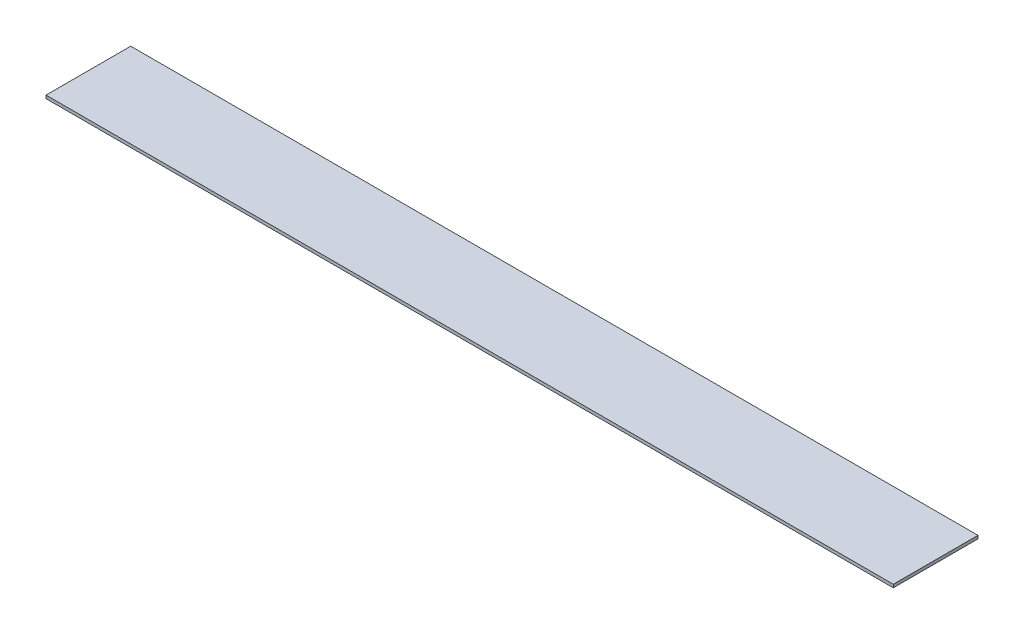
from build123d import *

# Parameters (mm, degrees)
ESQUISSE2_W        = 550
ESQUISSE2_H        = 55
BOSS_EXTRU_1_DEPTH = 2


with BuildPart() as part:
    # Esquisse2 → Boss.-Extru.1 (new body)
    with BuildSketch(Plane(origin=(0, 0, 0), x_dir=(1, 0, 0), z_dir=(0, 1, 0))):
        Rectangle(ESQUISSE2_W, ESQUISSE2_H)
    extrude(amount=BOSS_EXTRU_1_DEPTH)


solid = part.part
